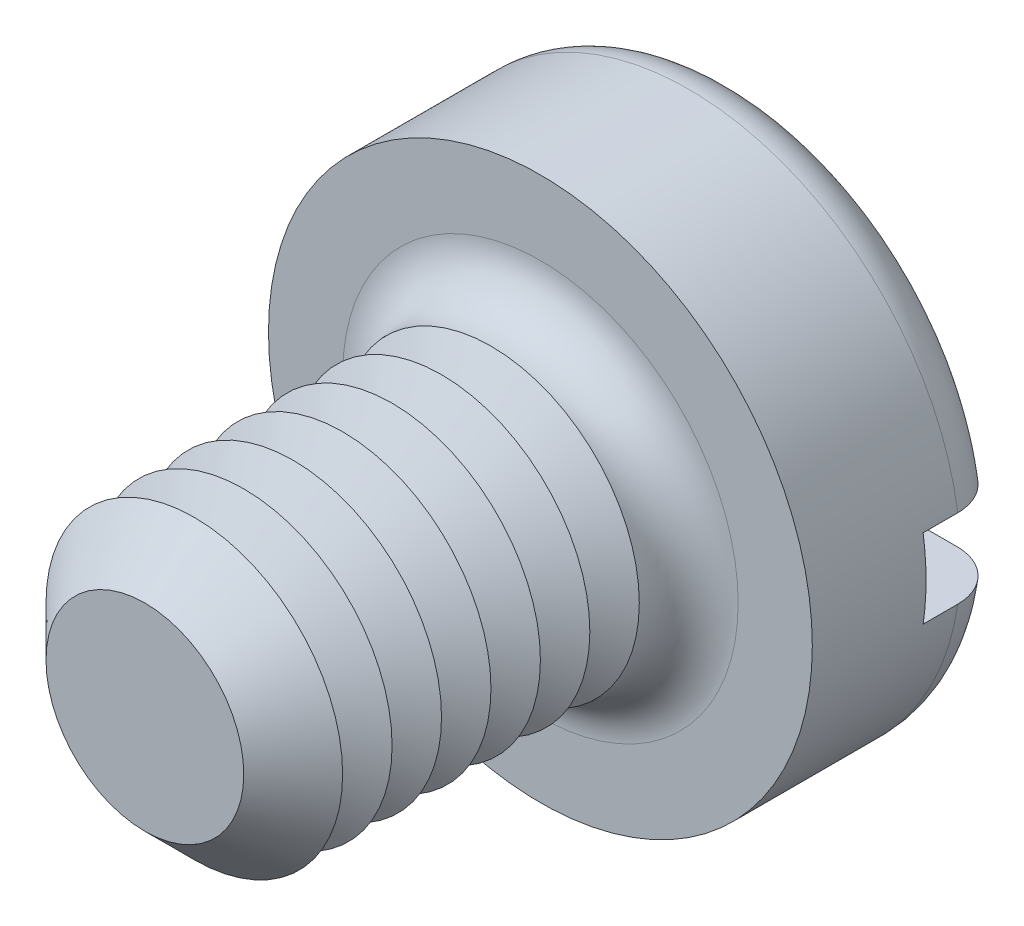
from build123d import *

# Parameters (mm, degrees)
SKETCH3_R           = 2.75
BOSS_EXTRUDE2_DEPTH = 2
SKETCH4_R           = 1.5
BOSS_EXTRUDE3_DEPTH = 4
FILLET1_R           = 0.5
CHAMFER1_SIZE       = 0.5
LPATTERN1_COUNT     = 6
LPATTERN1_PITCH     = 0.5
SKETCH8_W           = 5.5
SKETCH8_H           = 0.8
CUT_EXTRUDE1_DEPTH  = 0.85


with BuildPart() as part:
    # Sketch3 → Boss-Extrude2 (new body)
    with BuildSketch(Plane.XY):
        Circle(SKETCH3_R)
    extrude(amount=-BOSS_EXTRUDE2_DEPTH)

    # Sketch4 → Boss-Extrude3 (add)
    with BuildSketch(Plane.XY):
        Circle(SKETCH4_R)
    extrude(amount=BOSS_EXTRUDE3_DEPTH)

    # Fillet1
    fillet1_edges = [part.edges().sort_by_distance(p)[0] for p in [
        (-2.75, 0, -2),
        (-1.5, 0, 0),
    ]]
    fillet(fillet1_edges, radius=FILLET1_R)

    # Chamfer1
    chamfer1_edges = [part.edges().sort_by_distance(p)[0] for p in [
        (-1.5, 0, 4),
    ]]
    chamfer(chamfer1_edges, length=CHAMFER1_SIZE)

    # Sketch6 → Cut-Revolve1 (revolve, cut)
    with BuildSketch(Plane(origin=(0, 0, 0), x_dir=(0, 0, -1), z_dir=(1, 0, 0)), mode=Mode.PRIVATE) as cut_revolve1_sk:
        Polygon((-0.5, 1.5), (-0.75, 1.066987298), (-1, 1.5), align=None)
    cut_revolve1 = revolve(cut_revolve1_sk.sketch.rotate(Axis((0, 0, -1.694361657), (0, 0, 1)), 90), axis=Axis((0, 0, -1.694361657), (0, 0, 1)), mode=Mode.SUBTRACT)

    # LPattern1: Cut-Revolve1 ×6
    with Locations(*[(0, 0, i * LPATTERN1_PITCH) for i in range(1, LPATTERN1_COUNT)]):
        add(cut_revolve1, mode=Mode.SUBTRACT)

    # Sketch8 → Cut-Extrude1 (cut)
    with BuildSketch(Plane(origin=(0, 0, -2), x_dir=(-1, 0, 0), z_dir=(0, 0, -1))):
        Rectangle(SKETCH8_W, SKETCH8_H)
    extrude(amount=-CUT_EXTRUDE1_DEPTH, mode=Mode.SUBTRACT)


solid = part.part
